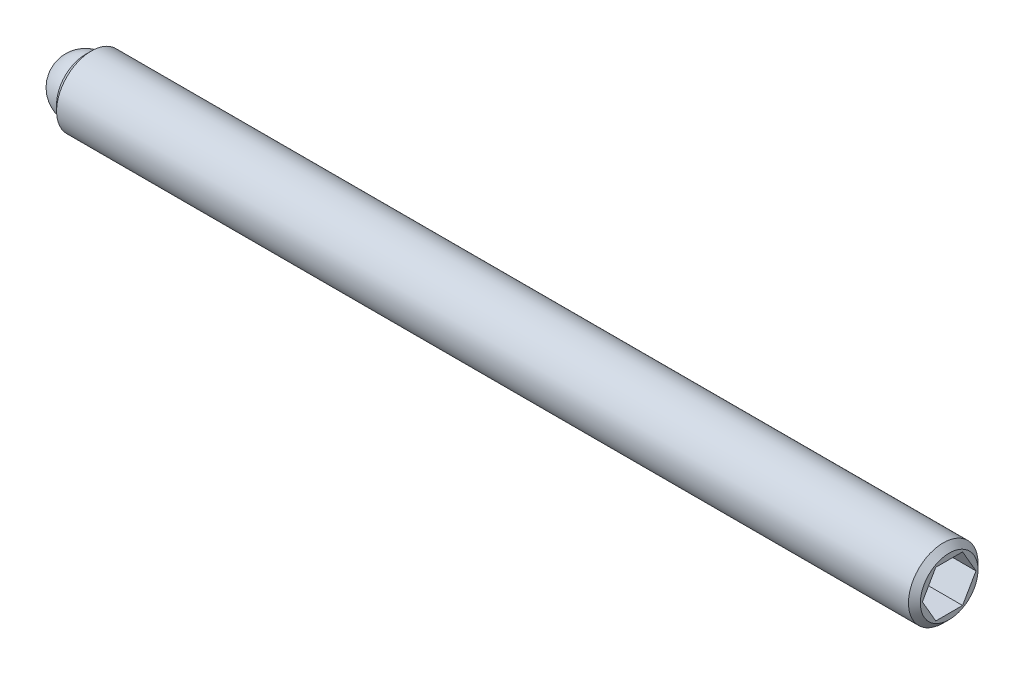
from build123d import *

# Parameters (mm, degrees)
SKETCH2_R           = 1.4859
BOSS_EXTRUDE1_DEPTH = 36.909375
CHAMFER1_SIZE       = 0.254
CHAMFER2_SIZE       = 0.254
CUT_EXTRUDE2_DEPTH  = 2.286
SKETCH3_R           = 1.190625
CUT_EXTRUDE3_DEPTH  = 1.190625


with BuildPart() as part:
    # Sketch2 → Boss-Extrude1 (new body)
    with BuildSketch(Plane(origin=(0, 0, 0), x_dir=(0, 0, -1), z_dir=(1, 0, 0))):
        Circle(SKETCH2_R)
    extrude(amount=BOSS_EXTRUDE1_DEPTH)

    # Chamfer1
    chamfer1_edges = [part.edges().sort_by_distance(p)[0] for p in [
        (0, 0, 1.4859),
    ]]
    chamfer(chamfer1_edges, length=CHAMFER1_SIZE)

    # Chamfer2
    chamfer2_edges = [part.edges().sort_by_distance(p)[0] for p in [
        (36.909375, 0, 1.4859),
    ]]
    chamfer(chamfer2_edges, length=CHAMFER2_SIZE)

    # Sketch4 → Cut-Extrude2 (cut)
    with BuildSketch(Plane(origin=(36.909375, 0, 0), x_dir=(0, 0, -1), z_dir=(1, 0, 0))):
        Polygon((1.14567944, 0), (0.57283972, 0.9921875), (-0.57283972, 0.9921875), (-1.14567944, 0), (-0.57283972, -0.9921875), (0.57283972, -0.9921875), align=None)
    extrude(amount=-CUT_EXTRUDE2_DEPTH, mode=Mode.SUBTRACT)

    # Sketch3 → Cut-Extrude3 (cut)
    with BuildSketch(Plane.ZY):
        Circle(SKETCH3_R)
    extrude(amount=-CUT_EXTRUDE3_DEPTH, mode=Mode.SUBTRACT)


with BuildPart() as body_2:
    # Sketch5 → Revolve1 (revolve)
    with BuildSketch(Plane.ZY):
        with BuildLine():
            Line((0, 0), (0, -1.190625))
            ThreePointArc((0, -1.190625), (-1.190625, 0), (0, 1.190625))
            Line((0, 1.190625), (0, 0))
        make_face()
    revolve(axis=Axis((0, 0, 0), (0, 1, 0)))


solid = Compound([part.part, body_2.part])
